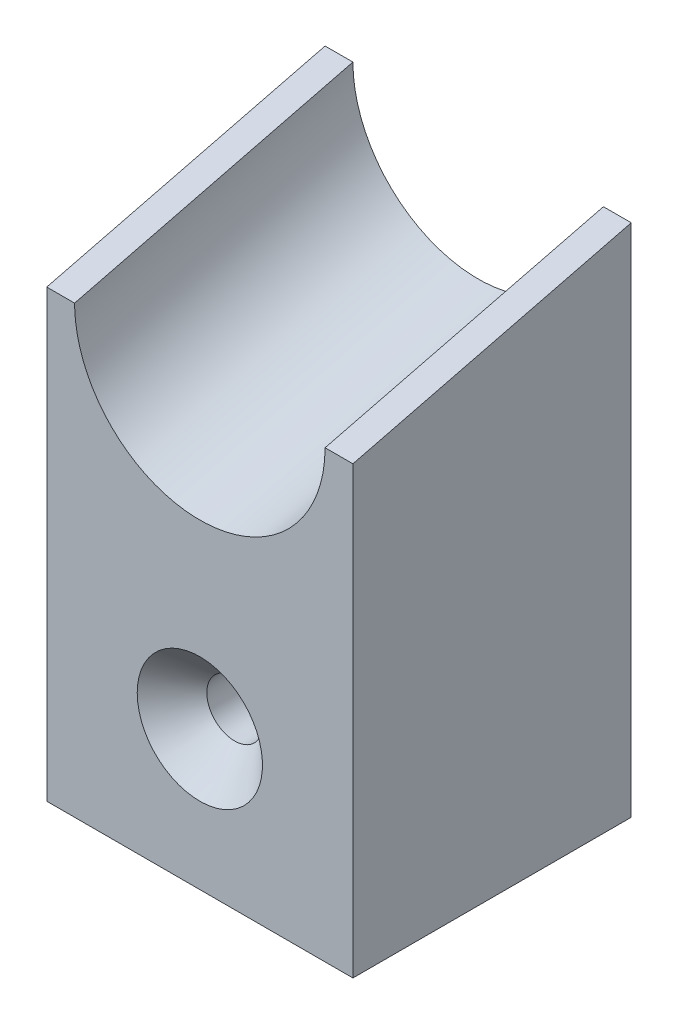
ISO-10303-21;
HEADER;
FILE_DESCRIPTION(('STEP AP214'),'2;1');
FILE_NAME('part.step','',(''),(''),'','','');
FILE_SCHEMA(('AUTOMOTIVE_DESIGN { 1 0 10303 214 1 1 1 1 }'));
ENDSEC;
DATA;
#1=APPLICATION_CONTEXT('core data for automotive mechanical design processes');
#2=APPLICATION_PROTOCOL_DEFINITION('international standard','automotive_design',2000,#1);
#3=PRODUCT_CONTEXT('',#1,'mechanical');
#4=PRODUCT('Part','Part','',(#3));
#5=PRODUCT_RELATED_PRODUCT_CATEGORY('part','',(#4));
#6=PRODUCT_DEFINITION_FORMATION('','',#4);
#7=PRODUCT_DEFINITION_CONTEXT('part definition',#1,'design');
#8=PRODUCT_DEFINITION('design','',#6,#7);
#9=PRODUCT_DEFINITION_SHAPE('','',#8);
#10=(LENGTH_UNIT() NAMED_UNIT(*) SI_UNIT(.MILLI.,.METRE.));
#11=(NAMED_UNIT(*) PLANE_ANGLE_UNIT() SI_UNIT($,.RADIAN.));
#12=(NAMED_UNIT(*) SI_UNIT($,.STERADIAN.) SOLID_ANGLE_UNIT());
#13=UNCERTAINTY_MEASURE_WITH_UNIT(LENGTH_MEASURE(1.E-05),#10,'distance_accuracy_value','');
#14=(GEOMETRIC_REPRESENTATION_CONTEXT(3) GLOBAL_UNCERTAINTY_ASSIGNED_CONTEXT((#13)) GLOBAL_UNIT_ASSIGNED_CONTEXT((#10,
#11,#12)) REPRESENTATION_CONTEXT('',''));
#15=CARTESIAN_POINT('',(0.,0.,0.));
#16=DIRECTION('',(0.,0.,1.));
#17=DIRECTION('',(1.,0.,0.));
#18=AXIS2_PLACEMENT_3D('',#15,#16,#17);
#19=CARTESIAN_POINT('',(73.0822214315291,37.,-10.));
#20=DIRECTION('',(0.,-0.970142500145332,-0.242535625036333));
#21=DIRECTION('',(0.,0.242535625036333,-0.970142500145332));
#22=AXIS2_PLACEMENT_3D('',#19,#20,#21);
#23=PLANE('',#22);
#24=DIRECTION('',(-1.,0.,0.));
#25=VECTOR('',#24,1.);
#26=CARTESIAN_POINT('',(73.0822214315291,32.,10.));
#27=LINE('',#26,#25);
#28=CARTESIAN_POINT('',(-9.,32.,10.));
#29=VERTEX_POINT('',#28);
#30=CARTESIAN_POINT('',(-11.,32.,10.));
#31=VERTEX_POINT('',#30);
#32=EDGE_CURVE('E66',#29,#31,#27,.T.);
#33=ORIENTED_EDGE('',*,*,#32,.F.);
#34=DIRECTION('',(0.,0.242535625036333,-0.970142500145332));
#35=VECTOR('',#34,1.);
#36=CARTESIAN_POINT('',(-9.,28.0261818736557,25.8952725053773));
#37=LINE('',#36,#35);
#38=CARTESIAN_POINT('',(-9.,37.,-10.));
#39=VERTEX_POINT('',#38);
#40=EDGE_CURVE('E192',#29,#39,#37,.T.);
#41=ORIENTED_EDGE('',*,*,#40,.T.);
#42=DIRECTION('',(-1.,0.,0.));
#43=VECTOR('',#42,1.);
#44=CARTESIAN_POINT('',(-11.,37.,-10.));
#45=LINE('',#44,#43);
#46=CARTESIAN_POINT('',(-11.,37.,-10.));
#47=VERTEX_POINT('',#46);
#48=EDGE_CURVE('E177',#39,#47,#45,.T.);
#49=ORIENTED_EDGE('',*,*,#48,.T.);
#50=DIRECTION('',(0.,0.242535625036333,-0.970142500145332));
#51=VECTOR('',#50,1.);
#52=CARTESIAN_POINT('',(-11.,37.,-10.));
#53=LINE('',#52,#51);
#54=EDGE_CURVE('E170',#31,#47,#53,.T.);
#55=ORIENTED_EDGE('',*,*,#54,.F.);
#56=EDGE_LOOP('',(#33,#41,#49,#55));
#57=FACE_BOUND('',#56,.T.);
#58=ADVANCED_FACE('F44',(#57),#23,.F.);
#59=CARTESIAN_POINT('',(11.,37.,-10.));
#60=DIRECTION('',(-1.,0.,0.));
#61=DIRECTION('',(0.,0.,1.));
#62=AXIS2_PLACEMENT_3D('',#59,#60,#61);
#63=PLANE('',#62);
#64=DIRECTION('',(0.,-1.,0.));
#65=VECTOR('',#64,1.);
#66=CARTESIAN_POINT('',(11.,37.,-10.));
#67=LINE('',#66,#65);
#68=CARTESIAN_POINT('',(11.,37.,-10.));
#69=VERTEX_POINT('',#68);
#70=CARTESIAN_POINT('',(11.,0.,-10.));
#71=VERTEX_POINT('',#70);
#72=EDGE_CURVE('E156',#69,#71,#67,.T.);
#73=ORIENTED_EDGE('',*,*,#72,.F.);
#74=DIRECTION('',(0.,-0.242535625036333,0.970142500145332));
#75=VECTOR('',#74,1.);
#76=CARTESIAN_POINT('',(11.,37.,-10.));
#77=LINE('',#76,#75);
#78=CARTESIAN_POINT('',(11.,32.,10.));
#79=VERTEX_POINT('',#78);
#80=EDGE_CURVE('E158',#69,#79,#77,.T.);
#81=ORIENTED_EDGE('',*,*,#80,.T.);
#82=DIRECTION('',(0.,-1.,0.));
#83=VECTOR('',#82,1.);
#84=CARTESIAN_POINT('',(11.,37.,10.));
#85=LINE('',#84,#83);
#86=CARTESIAN_POINT('',(11.,0.,10.));
#87=VERTEX_POINT('',#86);
#88=EDGE_CURVE('E176',#79,#87,#85,.T.);
#89=ORIENTED_EDGE('',*,*,#88,.T.);
#90=DIRECTION('',(0.,0.,-1.));
#91=VECTOR('',#90,1.);
#92=CARTESIAN_POINT('',(11.,0.,-10.));
#93=LINE('',#92,#91);
#94=EDGE_CURVE('E161',#87,#71,#93,.T.);
#95=ORIENTED_EDGE('',*,*,#94,.T.);
#96=EDGE_LOOP('',(#73,#81,#89,#95));
#97=FACE_BOUND('',#96,.T.);
#98=ADVANCED_FACE('F145',(#97),#63,.F.);
#99=CARTESIAN_POINT('',(-11.,37.,-10.));
#100=DIRECTION('',(0.,0.,1.));
#101=DIRECTION('',(1.,0.,0.));
#102=AXIS2_PLACEMENT_3D('',#99,#100,#101);
#103=PLANE('',#102);
#104=ORIENTED_EDGE('',*,*,#48,.F.);
#105=CARTESIAN_POINT('',(0.,37.,-10.));
#106=DIRECTION('',(0.,0.,-1.));
#107=DIRECTION('',(-1.,0.,0.));
#108=AXIS2_PLACEMENT_3D('',#105,#106,#107);
#109=CIRCLE('',#108,9.);
#110=CARTESIAN_POINT('',(9.,37.,-10.));
#111=VERTEX_POINT('',#110);
#112=EDGE_CURVE('E108',#111,#39,#109,.T.);
#113=ORIENTED_EDGE('',*,*,#112,.F.);
#114=EDGE_CURVE('E168',#69,#111,#45,.T.);
#115=ORIENTED_EDGE('',*,*,#114,.F.);
#116=ORIENTED_EDGE('',*,*,#72,.T.);
#117=DIRECTION('',(-1.,0.,0.));
#118=VECTOR('',#117,1.);
#119=CARTESIAN_POINT('',(-11.,0.,-10.));
#120=LINE('',#119,#118);
#121=CARTESIAN_POINT('',(-11.,0.,-10.));
#122=VERTEX_POINT('',#121);
#123=EDGE_CURVE('E172',#71,#122,#120,.T.);
#124=ORIENTED_EDGE('',*,*,#123,.T.);
#125=DIRECTION('',(0.,-1.,0.));
#126=VECTOR('',#125,1.);
#127=CARTESIAN_POINT('',(-11.,37.,-10.));
#128=LINE('',#127,#126);
#129=EDGE_CURVE('E163',#47,#122,#128,.T.);
#130=ORIENTED_EDGE('',*,*,#129,.F.);
#131=EDGE_LOOP('',(#104,#113,#115,#116,#124,#130));
#132=FACE_BOUND('',#131,.T.);
#133=ADVANCED_FACE('F142',(#132),#103,.F.);
#134=CARTESIAN_POINT('',(-11.,37.,-10.));
#135=DIRECTION('',(1.,0.,0.));
#136=DIRECTION('',(0.,0.,-1.));
#137=AXIS2_PLACEMENT_3D('',#134,#135,#136);
#138=PLANE('',#137);
#139=DIRECTION('',(0.,-1.,0.));
#140=VECTOR('',#139,1.);
#141=CARTESIAN_POINT('',(-11.,37.,10.));
#142=LINE('',#141,#140);
#143=CARTESIAN_POINT('',(-11.,0.,10.));
#144=VERTEX_POINT('',#143);
#145=EDGE_CURVE('E187',#31,#144,#142,.T.);
#146=ORIENTED_EDGE('',*,*,#145,.F.);
#147=ORIENTED_EDGE('',*,*,#54,.T.);
#148=ORIENTED_EDGE('',*,*,#129,.T.);
#149=DIRECTION('',(0.,0.,1.));
#150=VECTOR('',#149,1.);
#151=CARTESIAN_POINT('',(-11.,0.,-10.));
#152=LINE('',#151,#150);
#153=EDGE_CURVE('E180',#122,#144,#152,.T.);
#154=ORIENTED_EDGE('',*,*,#153,.T.);
#155=EDGE_LOOP('',(#146,#147,#148,#154));
#156=FACE_BOUND('',#155,.T.);
#157=ADVANCED_FACE('F138',(#156),#138,.F.);
#158=CARTESIAN_POINT('',(-11.,37.,10.));
#159=DIRECTION('',(0.,0.,-1.));
#160=DIRECTION('',(-1.,0.,0.));
#161=AXIS2_PLACEMENT_3D('',#158,#159,#160);
#162=PLANE('',#161);
#163=CARTESIAN_POINT('',(0.,10.,10.));
#164=DIRECTION('',(0.,0.,-1.));
#165=DIRECTION('',(-1.,0.,0.));
#166=AXIS2_PLACEMENT_3D('',#163,#164,#165);
#167=CIRCLE('',#166,4.50000000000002);
#168=CARTESIAN_POINT('',(-4.50000000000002,10.,10.));
#169=VERTEX_POINT('',#168);
#170=EDGE_CURVE('E13',#169,#169,#167,.T.);
#171=ORIENTED_EDGE('',*,*,#170,.T.);
#172=EDGE_LOOP('',(#171));
#173=FACE_BOUND('',#172,.T.);
#174=CARTESIAN_POINT('',(9.00000000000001,32.,10.));
#175=VERTEX_POINT('',#174);
#176=EDGE_CURVE('E131',#79,#175,#27,.T.);
#177=ORIENTED_EDGE('',*,*,#176,.T.);
#178=CARTESIAN_POINT('',(9.,32.,10.));
#179=CARTESIAN_POINT('',(9.00002564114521,31.7505907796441,10.));
#180=CARTESIAN_POINT('',(8.98963357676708,31.5011852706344,10.));
#181=CARTESIAN_POINT('',(8.94819921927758,31.0041058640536,10.));
#182=CARTESIAN_POINT('',(8.91715782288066,30.756431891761,10.));
#183=CARTESIAN_POINT('',(8.83460881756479,30.2645110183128,10.));
#184=CARTESIAN_POINT('',(8.78310064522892,30.0202642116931,10.));
#185=CARTESIAN_POINT('',(8.65998267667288,29.5368938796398,10.));
#186=CARTESIAN_POINT('',(8.58837311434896,29.2977702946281,10.));
#187=CARTESIAN_POINT('',(8.42554472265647,28.8262957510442,10.));
#188=CARTESIAN_POINT('',(8.33432592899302,28.5939447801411,10.));
#189=CARTESIAN_POINT('',(8.13290809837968,28.1376163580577,10.));
#190=CARTESIAN_POINT('',(8.02270877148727,27.9136390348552,10.));
#191=CARTESIAN_POINT('',(7.78409254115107,27.4756099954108,10.));
#192=CARTESIAN_POINT('',(7.65567573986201,27.2615582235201,10.));
#193=CARTESIAN_POINT('',(7.38151169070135,26.8448582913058,10.));
#194=CARTESIAN_POINT('',(7.23576451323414,26.6422100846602,10.));
#195=CARTESIAN_POINT('',(6.92797163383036,26.2497487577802,10.));
#196=CARTESIAN_POINT('',(6.76592864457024,26.0599335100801,10.));
#197=CARTESIAN_POINT('',(6.42658568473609,25.6943502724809,10.));
#198=CARTESIAN_POINT('',(6.2492805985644,25.5185870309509,10.));
#199=CARTESIAN_POINT('',(5.88071791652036,25.1824229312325,10.));
#200=CARTESIAN_POINT('',(5.68946277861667,25.0220193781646,10.));
#201=CARTESIAN_POINT('',(5.29429048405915,24.7176452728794,10.));
#202=CARTESIAN_POINT('',(5.09037313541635,24.5736749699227,10.));
#203=CARTESIAN_POINT('',(4.67129144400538,24.3031671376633,10.));
#204=CARTESIAN_POINT('',(4.45612730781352,24.1766292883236,10.));
#205=CARTESIAN_POINT('',(4.01602998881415,23.9418547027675,10.));
#206=CARTESIAN_POINT('',(3.79109659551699,23.8336183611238,10.));
#207=CARTESIAN_POINT('',(3.33305987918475,23.6362154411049,10.));
#208=CARTESIAN_POINT('',(3.09995802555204,23.5470454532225,10.));
#209=CARTESIAN_POINT('',(2.62707618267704,23.3883397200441,10.));
#210=CARTESIAN_POINT('',(2.38729397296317,23.3188105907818,10.));
#211=CARTESIAN_POINT('',(1.90282668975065,23.1999175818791,10.));
#212=CARTESIAN_POINT('',(1.65814249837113,23.1505501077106,10.));
#213=CARTESIAN_POINT('',(1.16551475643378,23.0723027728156,10.));
#214=CARTESIAN_POINT('',(0.917571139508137,23.0434233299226,10.));
#215=CARTESIAN_POINT('',(0.420147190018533,23.0063535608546,10.));
#216=CARTESIAN_POINT('',(0.170666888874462,22.9981628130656,10.));
#217=CARTESIAN_POINT('',(-0.328117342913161,23.0025258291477,10.));
#218=CARTESIAN_POINT('',(-0.577421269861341,23.0150800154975,10.));
#219=CARTESIAN_POINT('',(-1.07412308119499,23.0608467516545,10.));
#220=CARTESIAN_POINT('',(-1.32152098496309,23.0940590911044,10.));
#221=CARTESIAN_POINT('',(-1.81270447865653,23.1809125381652,10.));
#222=CARTESIAN_POINT('',(-2.05649006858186,23.2345536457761,10.));
#223=CARTESIAN_POINT('',(-2.53876750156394,23.361894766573,10.));
#224=CARTESIAN_POINT('',(-2.77725929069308,23.4355949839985,10.));
#225=CARTESIAN_POINT('',(-3.24729440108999,23.602543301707,10.));
#226=CARTESIAN_POINT('',(-3.47883786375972,23.6957910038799,10.));
#227=CARTESIAN_POINT('',(-3.93338674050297,23.9011932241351,10.));
#228=CARTESIAN_POINT('',(-4.15639198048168,24.0133481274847,10.));
#229=CARTESIAN_POINT('',(-4.59231456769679,24.2557862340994,10.));
#230=CARTESIAN_POINT('',(-4.80523212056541,24.3860690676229,10.));
#231=CARTESIAN_POINT('',(-5.21955056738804,24.6638897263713,10.));
#232=CARTESIAN_POINT('',(-5.42094940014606,24.8114306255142,10.));
#233=CARTESIAN_POINT('',(-5.81073205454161,25.1226768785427,10.));
#234=CARTESIAN_POINT('',(-5.99912023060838,25.286376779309,10.));
#235=CARTESIAN_POINT('',(-6.36168786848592,25.6288831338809,10.));
#236=CARTESIAN_POINT('',(-6.5358647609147,25.8076923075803,10.));
#237=CARTESIAN_POINT('',(-6.8687647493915,26.1791520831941,10.));
#238=CARTESIAN_POINT('',(-7.02748822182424,26.3718023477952,10.));
#239=CARTESIAN_POINT('',(-7.32839291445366,26.7696214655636,10.));
#240=CARTESIAN_POINT('',(-7.47057379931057,26.9747905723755,10.));
#241=CARTESIAN_POINT('',(-7.73740541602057,27.3962235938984,10.));
#242=CARTESIAN_POINT('',(-7.86205643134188,27.6124873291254,10.));
#243=CARTESIAN_POINT('',(-8.09299271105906,28.0546616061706,10.));
#244=CARTESIAN_POINT('',(-8.19927431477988,28.2805740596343,10.));
#245=CARTESIAN_POINT('',(-8.39267141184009,28.7403617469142,10.));
#246=CARTESIAN_POINT('',(-8.47979420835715,28.9742339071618,10.));
#247=CARTESIAN_POINT('',(-8.62936857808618,29.4331992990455,10.));
#248=CARTESIAN_POINT('',(-8.69304319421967,29.6578949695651,10.));
#249=CARTESIAN_POINT('',(-8.80272264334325,30.1114812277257,10.));
#250=CARTESIAN_POINT('',(-8.84873339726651,30.3403703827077,10.));
#251=CARTESIAN_POINT('',(-8.92365068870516,30.8061423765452,10.));
#252=CARTESIAN_POINT('',(-8.9521553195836,31.0430899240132,10.));
#253=CARTESIAN_POINT('',(-8.99040147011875,31.5200177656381,10.));
#254=CARTESIAN_POINT('',(-9.00002200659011,31.7600077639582,10.));
#255=CARTESIAN_POINT('',(-9.,32.,10.));
#256=B_SPLINE_CURVE_WITH_KNOTS('',3,(#178,#179,#180,#181,#182,#183,#184,#185,#186,#187,#188,
#189,#190,#191,#192,#193,#194,#195,#196,#197,#198,#199,#200,#201,#202,#203,#204,#205,#206,#207,
#208,#209,#210,#211,#212,#213,#214,#215,#216,#217,#218,#219,#220,#221,#222,#223,#224,#225,#226,
#227,#228,#229,#230,#231,#232,#233,#234,#235,#236,#237,#238,#239,#240,#241,#242,#243,#244,#245,
#246,#247,#248,#249,#250,#251,#252,#253,#254,#255),.UNSPECIFIED.,.F.,.F.,(4,2,2,2,2,2,2,2,2,2,2,
2,2,2,2,2,2,2,2,2,2,2,2,2,2,2,2,2,2,2,2,2,2,2,2,2,2,2,4),(0.,0.748005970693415,1.49597946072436,
2.24397354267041,2.99195892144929,3.73994293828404,4.48793838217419,5.23592963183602,
5.98391784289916,6.73178174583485,7.47989730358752,8.22788136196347,8.97587676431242,
9.72385843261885,10.4718562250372,11.2197201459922,11.9678356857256,12.7158177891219,
13.4638151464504,14.2117972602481,14.9597946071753,15.707784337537,16.4557740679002,
17.203771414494,17.9517535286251,18.6997508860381,19.4477329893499,20.1958485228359,
20.9437124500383,21.6917112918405,22.439691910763,23.1876876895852,23.9356713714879,
24.6838039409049,25.4316508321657,26.1315835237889,26.8312813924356,27.5464949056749,
28.2662757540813),.UNSPECIFIED.);
#257=EDGE_CURVE('E59',#175,#29,#256,.T.);
#258=ORIENTED_EDGE('',*,*,#257,.T.);
#259=ORIENTED_EDGE('',*,*,#32,.T.);
#260=ORIENTED_EDGE('',*,*,#145,.T.);
#261=DIRECTION('',(1.,0.,0.));
#262=VECTOR('',#261,1.);
#263=CARTESIAN_POINT('',(-11.,0.,10.));
#264=LINE('',#263,#262);
#265=EDGE_CURVE('E183',#144,#87,#264,.T.);
#266=ORIENTED_EDGE('',*,*,#265,.T.);
#267=ORIENTED_EDGE('',*,*,#88,.F.);
#268=EDGE_LOOP('',(#177,#258,#259,#260,#266,#267));
#269=FACE_BOUND('',#268,.T.);
#270=ADVANCED_FACE('F133',(#173,#269),#162,.F.);
#271=CARTESIAN_POINT('',(11.,0.,10.));
#272=DIRECTION('',(0.,1.,0.));
#273=DIRECTION('',(0.,0.,1.));
#274=AXIS2_PLACEMENT_3D('',#271,#272,#273);
#275=PLANE('',#274);
#276=CARTESIAN_POINT('',(0.,0.,0.));
#277=DIRECTION('',(0.,-1.,0.));
#278=DIRECTION('',(0.,0.,-1.));
#279=AXIS2_PLACEMENT_3D('',#276,#277,#278);
#280=CIRCLE('',#279,4.);
#281=CARTESIAN_POINT('',(0.,0.,-4.));
#282=VERTEX_POINT('',#281);
#283=EDGE_CURVE('E109',#282,#282,#280,.T.);
#284=ORIENTED_EDGE('',*,*,#283,.F.);
#285=EDGE_LOOP('',(#284));
#286=FACE_BOUND('',#285,.T.);
#287=ORIENTED_EDGE('',*,*,#94,.F.);
#288=ORIENTED_EDGE('',*,*,#265,.F.);
#289=ORIENTED_EDGE('',*,*,#153,.F.);
#290=ORIENTED_EDGE('',*,*,#123,.F.);
#291=EDGE_LOOP('',(#287,#288,#289,#290));
#292=FACE_BOUND('',#291,.T.);
#293=ADVANCED_FACE('F137',(#286,#292),#275,.F.);
#294=ORIENTED_EDGE('',*,*,#114,.T.);
#295=DIRECTION('',(0.,0.242535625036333,-0.970142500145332));
#296=VECTOR('',#295,1.);
#297=CARTESIAN_POINT('',(9.,28.0261818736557,25.8952725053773));
#298=LINE('',#297,#296);
#299=EDGE_CURVE('E162',#111,#175,#298,.F.);
#300=ORIENTED_EDGE('',*,*,#299,.T.);
#301=ORIENTED_EDGE('',*,*,#176,.F.);
#302=ORIENTED_EDGE('',*,*,#80,.F.);
#303=EDGE_LOOP('',(#294,#300,#301,#302));
#304=FACE_BOUND('',#303,.T.);
#305=ADVANCED_FACE('F123',(#304),#23,.F.);
#306=CARTESIAN_POINT('',(0.,28.0261818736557,25.8952725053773));
#307=DIRECTION('',(0.,0.,-1.));
#308=DIRECTION('',(-1.,0.,0.));
#309=AXIS2_PLACEMENT_3D('',#306,#307,#308);
#310=CIRCLE('',#309,9.);
#311=DIRECTION('',(0.,0.242535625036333,-0.970142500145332));
#312=VECTOR('',#311,1.);
#313=SURFACE_OF_LINEAR_EXTRUSION('',#310,#312);
#314=ORIENTED_EDGE('',*,*,#257,.F.);
#315=ORIENTED_EDGE('',*,*,#299,.F.);
#316=ORIENTED_EDGE('',*,*,#112,.T.);
#317=ORIENTED_EDGE('',*,*,#40,.F.);
#318=EDGE_LOOP('',(#314,#315,#316,#317));
#319=FACE_BOUND('',#318,.T.);
#320=ADVANCED_FACE('F102',(#319),#313,.F.);
#321=CARTESIAN_POINT('',(0.,19.,0.));
#322=DIRECTION('',(0.,-1.,0.));
#323=DIRECTION('',(0.,0.,-1.));
#324=AXIS2_PLACEMENT_3D('',#321,#322,#323);
#325=CONICAL_SURFACE('',#324,4.,1.02974425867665);
#326=CARTESIAN_POINT('',(0.,21.4034424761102,0.));
#327=VERTEX_POINT('',#326);
#328=VERTEX_LOOP('',#327);
#329=FACE_BOUND('',#328,.T.);
#330=CARTESIAN_POINT('',(0.,19.,0.));
#331=DIRECTION('',(0.,-1.,0.));
#332=DIRECTION('',(0.,0.,-1.));
#333=AXIS2_PLACEMENT_3D('',#330,#331,#332);
#334=CIRCLE('',#333,4.);
#335=CARTESIAN_POINT('',(0.,19.,-4.));
#336=VERTEX_POINT('',#335);
#337=EDGE_CURVE('E106',#336,#336,#334,.T.);
#338=ORIENTED_EDGE('',*,*,#337,.T.);
#339=EDGE_LOOP('',(#338));
#340=FACE_BOUND('',#339,.T.);
#341=ADVANCED_FACE('F98',(#329,#340),#325,.F.);
#342=CARTESIAN_POINT('',(0.,0.,0.));
#343=DIRECTION('',(0.,-1.,0.));
#344=DIRECTION('',(0.,0.,-1.));
#345=AXIS2_PLACEMENT_3D('',#342,#343,#344);
#346=CYLINDRICAL_SURFACE('',#345,4.);
#347=CARTESIAN_POINT('',(2.,10.,3.46410161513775));
#348=CARTESIAN_POINT('',(1.99999158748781,9.89578679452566,3.46411185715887));
#349=CARTESIAN_POINT('',(1.99179963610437,9.7914378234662,3.46887633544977));
#350=CARTESIAN_POINT('',(1.95944672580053,9.5859448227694,3.48724701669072));
#351=CARTESIAN_POINT('',(1.93525221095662,9.48480799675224,3.50087179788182));
#352=CARTESIAN_POINT('',(1.8721998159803,9.28909684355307,3.53498701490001));
#353=CARTESIAN_POINT('',(1.83341988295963,9.19449074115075,3.55544089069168));
#354=CARTESIAN_POINT('',(1.74253507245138,9.01315154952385,3.60085327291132));
#355=CARTESIAN_POINT('',(1.69042947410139,8.92641888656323,3.62581202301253));
#356=CARTESIAN_POINT('',(1.569333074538,8.75538855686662,3.67993738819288));
#357=CARTESIAN_POINT('',(1.49930407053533,8.67188173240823,3.70928127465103));
#358=CARTESIAN_POINT('',(1.34650761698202,8.5171832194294,3.76743965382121));
#359=CARTESIAN_POINT('',(1.26373385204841,8.44599767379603,3.79625387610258));
#360=CARTESIAN_POINT('',(1.08097912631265,8.3132656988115,3.85242953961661));
#361=CARTESIAN_POINT('',(0.980214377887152,8.25269246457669,3.87956212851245));
#362=CARTESIAN_POINT('',(0.768314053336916,8.14971829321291,3.92701512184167));
#363=CARTESIAN_POINT('',(0.657185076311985,8.1073058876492,3.94733982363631));
#364=CARTESIAN_POINT('',(0.436089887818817,8.04499067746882,3.97760922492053));
#365=CARTESIAN_POINT('',(0.326603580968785,8.0237009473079,3.98818960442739));
#366=CARTESIAN_POINT('',(0.10514125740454,7.99966776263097,4.00015167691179));
#367=CARTESIAN_POINT('',(-0.00683321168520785,7.99691308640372,4.00153893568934));
#368=CARTESIAN_POINT('',(-0.219665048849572,8.00949334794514,3.99525963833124));
#369=CARTESIAN_POINT('',(-0.320642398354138,8.02327603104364,3.9883699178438));
#370=CARTESIAN_POINT('',(-0.518627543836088,8.06576168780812,3.96748490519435));
#371=CARTESIAN_POINT('',(-0.615635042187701,8.09446577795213,3.95348908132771));
#372=CARTESIAN_POINT('',(-0.804618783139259,8.16616513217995,3.91943166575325));
#373=CARTESIAN_POINT('',(-0.896506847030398,8.20935262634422,3.89928883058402));
#374=CARTESIAN_POINT('',(-1.07195360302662,8.3085268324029,3.8547529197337));
#375=CARTESIAN_POINT('',(-1.15550929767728,8.36451812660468,3.83035832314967));
#376=CARTESIAN_POINT('',(-1.3203473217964,8.49379070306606,3.77688788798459));
#377=CARTESIAN_POINT('',(-1.40066815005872,8.56820605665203,3.7475875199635));
#378=CARTESIAN_POINT('',(-1.54820874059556,8.72917944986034,3.68908681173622));
#379=CARTESIAN_POINT('',(-1.61541842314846,8.81574674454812,3.65988656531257));
#380=CARTESIAN_POINT('',(-1.73901066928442,9.00529638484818,3.60288312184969));
#381=CARTESIAN_POINT('',(-1.7944346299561,9.10897204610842,3.57528639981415));
#382=CARTESIAN_POINT('',(-1.88663822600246,9.325875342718,3.52750900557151));
#383=CARTESIAN_POINT('',(-1.92343731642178,9.43909286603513,3.50732060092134));
#384=CARTESIAN_POINT('',(-1.97436042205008,9.66242902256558,3.47889271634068));
#385=CARTESIAN_POINT('',(-1.99005024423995,9.7720822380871,3.46983311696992));
#386=CARTESIAN_POINT('',(-2.00303389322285,9.99280268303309,3.46235838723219));
#387=CARTESIAN_POINT('',(-2.00034071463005,10.1038688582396,3.46393573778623));
#388=CARTESIAN_POINT('',(-1.97807208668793,10.3113078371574,3.47668673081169));
#389=CARTESIAN_POINT('',(-1.96037563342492,10.4079589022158,3.48679175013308));
#390=CARTESIAN_POINT('',(-1.91139256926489,10.596735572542,3.51388043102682));
#391=CARTESIAN_POINT('',(-1.88010155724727,10.6888597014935,3.53086632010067));
#392=CARTESIAN_POINT('',(-1.80329517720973,10.8708226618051,3.57072444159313));
#393=CARTESIAN_POINT('',(-1.7571881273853,10.9603580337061,3.59383286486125));
#394=CARTESIAN_POINT('',(-1.65257412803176,11.130938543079,3.643122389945));
#395=CARTESIAN_POINT('',(-1.59406080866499,11.2119792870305,3.66930506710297));
#396=CARTESIAN_POINT('',(-1.45767433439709,11.3739575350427,3.72575996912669));
#397=CARTESIAN_POINT('',(-1.37829054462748,11.4535943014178,3.75613166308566));
#398=CARTESIAN_POINT('',(-1.20680899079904,11.5988244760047,3.81468469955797));
#399=CARTESIAN_POINT('',(-1.11470694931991,11.6644131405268,3.84286530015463));
#400=CARTESIAN_POINT('',(-0.917070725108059,11.7811474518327,3.89482723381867));
#401=CARTESIAN_POINT('',(-0.811246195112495,11.8318662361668,3.91847283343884));
#402=CARTESIAN_POINT('',(-0.591044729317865,11.9142758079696,3.95766709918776));
#403=CARTESIAN_POINT('',(-0.476675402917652,11.9459833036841,3.97322287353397));
#404=CARTESIAN_POINT('',(-0.253959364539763,11.9867371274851,3.99335016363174));
#405=CARTESIAN_POINT('',(-0.146022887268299,11.9975957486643,3.9987985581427));
#406=CARTESIAN_POINT('',(0.0702519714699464,12.0016865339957,4.00084260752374));
#407=CARTESIAN_POINT('',(0.178590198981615,11.9949248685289,3.99744136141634));
#408=CARTESIAN_POINT('',(0.38507598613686,11.9651671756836,3.98267937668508));
#409=CARTESIAN_POINT('',(0.48342464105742,11.9432702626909,3.97185789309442));
#410=CARTESIAN_POINT('',(0.674891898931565,11.8853460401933,3.94384187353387));
#411=CARTESIAN_POINT('',(0.768009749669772,11.8493167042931,3.92664642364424));
#412=CARTESIAN_POINT('',(0.950846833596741,11.7625457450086,3.8865186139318));
#413=CARTESIAN_POINT('',(1.0402503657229,11.7112407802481,3.86337234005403));
#414=CARTESIAN_POINT('',(1.20954920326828,11.5960847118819,3.81376266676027));
#415=CARTESIAN_POINT('',(1.28944011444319,11.5322278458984,3.78729774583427));
#416=CARTESIAN_POINT('',(1.44582833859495,11.3864033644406,3.73057218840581));
#417=CARTESIAN_POINT('',(1.52119665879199,11.3032658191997,3.70019591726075));
#418=CARTESIAN_POINT('',(1.65732528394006,11.1251077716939,3.64126158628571));
#419=CARTESIAN_POINT('',(1.71807266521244,11.0300768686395,3.61270515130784));
#420=CARTESIAN_POINT('',(1.82486714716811,10.8266911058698,3.55999186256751));
#421=CARTESIAN_POINT('',(1.87038902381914,10.7180100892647,3.53600256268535));
#422=CARTESIAN_POINT('',(1.92395929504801,10.5494218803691,3.5069621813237));
#423=CARTESIAN_POINT('',(1.93935666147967,10.4923521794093,3.498443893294));
#424=CARTESIAN_POINT('',(1.96508069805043,10.3767674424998,3.48406059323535));
#425=CARTESIAN_POINT('',(1.97541091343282,10.3182534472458,3.4781937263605));
#426=CARTESIAN_POINT('',(1.9887293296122,10.2163992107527,3.47059023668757));
#427=CARTESIAN_POINT('',(1.99295091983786,10.1732669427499,3.46816389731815));
#428=CARTESIAN_POINT('',(1.99858810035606,10.0867643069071,3.46491740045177));
#429=CARTESIAN_POINT('',(2.00000350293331,10.0433939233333,3.46409735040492));
#430=CARTESIAN_POINT('',(2.,10.,3.46410161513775));
#431=B_SPLINE_CURVE_WITH_KNOTS('',3,(#347,#348,#349,#350,#351,#352,#353,#354,#355,#356,#357,
#358,#359,#360,#361,#362,#363,#364,#365,#366,#367,#368,#369,#370,#371,#372,#373,#374,#375,#376,
#377,#378,#379,#380,#381,#382,#383,#384,#385,#386,#387,#388,#389,#390,#391,#392,#393,#394,#395,
#396,#397,#398,#399,#400,#401,#402,#403,#404,#405,#406,#407,#408,#409,#410,#411,#412,#413,#414,
#415,#416,#417,#418,#419,#420,#421,#422,#423,#424,#425,#426,#427,#428,#429,#430),.UNSPECIFIED.,
.T.,.F.,(4,2,2,2,2,2,2,2,2,2,2,2,2,2,2,2,2,2,2,2,2,2,2,2,2,2,2,2,2,2,2,2,2,2,2,2,2,2,2,2,2,4),
(0.,0.312464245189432,0.62558578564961,0.937057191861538,1.24854545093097,1.58572462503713,
1.92307142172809,2.28315784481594,2.64301653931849,2.97726969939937,3.31132047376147,
3.61632194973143,3.92134625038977,4.2305906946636,4.5399459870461,4.87854382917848,
5.21740096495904,5.57777683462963,5.93777548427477,6.2692458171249,6.60048186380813,
6.89548366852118,7.19058104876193,7.49934592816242,7.80826972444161,8.15613487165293,
8.50411729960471,8.86128362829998,9.2181355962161,9.5422454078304,9.8662417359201,
10.1688884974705,10.4715786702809,10.7872150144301,11.102996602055,11.450204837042,
11.7977188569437,12.1562149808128,12.3351395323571,12.5139387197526,12.6440387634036,
12.7741475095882),.UNSPECIFIED.);
#432=CARTESIAN_POINT('',(2.,10.,3.46410161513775));
#433=VERTEX_POINT('',#432);
#434=EDGE_CURVE('E113',#433,#433,#431,.T.);
#435=ORIENTED_EDGE('',*,*,#434,.F.);
#436=EDGE_LOOP('',(#435));
#437=FACE_BOUND('',#436,.T.);
#438=ORIENTED_EDGE('',*,*,#337,.F.);
#439=EDGE_LOOP('',(#438));
#440=FACE_BOUND('',#439,.T.);
#441=ORIENTED_EDGE('',*,*,#283,.T.);
#442=EDGE_LOOP('',(#441));
#443=FACE_BOUND('',#442,.T.);
#444=ADVANCED_FACE('F101',(#437,#440,#443),#346,.F.);
#445=CARTESIAN_POINT('',(0.,10.,-10.001));
#446=DIRECTION('',(0.,0.,1.));
#447=DIRECTION('',(1.,0.,0.));
#448=AXIS2_PLACEMENT_3D('',#445,#446,#447);
#449=CYLINDRICAL_SURFACE('',#448,2.);
#450=CARTESIAN_POINT('',(0.,10.,7.49999999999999));
#451=DIRECTION('',(0.,0.,-1.));
#452=DIRECTION('',(-1.,0.,0.));
#453=AXIS2_PLACEMENT_3D('',#450,#451,#452);
#454=CIRCLE('',#453,2.);
#455=CARTESIAN_POINT('',(-2.,10.,7.49999999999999));
#456=VERTEX_POINT('',#455);
#457=EDGE_CURVE('E52',#456,#456,#454,.F.);
#458=ORIENTED_EDGE('',*,*,#457,.T.);
#459=EDGE_LOOP('',(#458));
#460=FACE_BOUND('',#459,.T.);
#461=ORIENTED_EDGE('',*,*,#434,.T.);
#462=EDGE_LOOP('',(#461));
#463=FACE_BOUND('',#462,.T.);
#464=ADVANCED_FACE('F197',(#460,#463),#449,.F.);
#465=CARTESIAN_POINT('',(0.,10.,7.49999999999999));
#466=DIRECTION('',(0.,0.,1.));
#467=DIRECTION('',(1.,0.,0.));
#468=AXIS2_PLACEMENT_3D('',#465,#466,#467);
#469=CONICAL_SURFACE('',#468,2.,0.78539816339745);
#470=ORIENTED_EDGE('',*,*,#170,.F.);
#471=EDGE_LOOP('',(#470));
#472=FACE_BOUND('',#471,.T.);
#473=ORIENTED_EDGE('',*,*,#457,.F.);
#474=EDGE_LOOP('',(#473));
#475=FACE_BOUND('',#474,.T.);
#476=ADVANCED_FACE('F46',(#472,#475),#469,.F.);
#477=CLOSED_SHELL('',(#58,#98,#133,#157,#270,#293,#305,#320,#341,#444,#464,#476));
#478=MANIFOLD_SOLID_BREP('B2',#477);
#479=ADVANCED_BREP_SHAPE_REPRESENTATION('',(#18,#478),#14);
#480=SHAPE_DEFINITION_REPRESENTATION(#9,#479);
ENDSEC;
END-ISO-10303-21;
